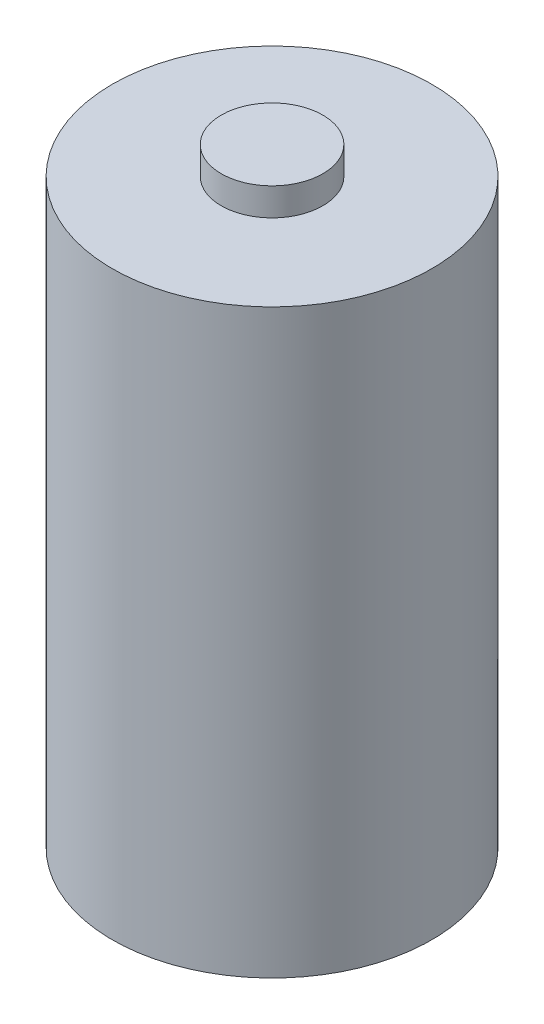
from build123d import *


with BuildPart() as part:
    # Sketch1 → Revolve1 (revolve)
    with BuildSketch(Plane.XY, mode=Mode.PRIVATE) as revolve1_sk:
        Polygon((0, 0), (15.494, 0), (15.494, 56.3626), (4.9276, 56.3626), (4.9276, 59.055), (0, 59.055), align=None)
    revolve(revolve1_sk.sketch.rotate(Axis((0, 70.031612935, 0), (0, -1, 0)), 180), axis=Axis((0, 70.031612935, 0), (0, -1, 0)))


solid = part.part
